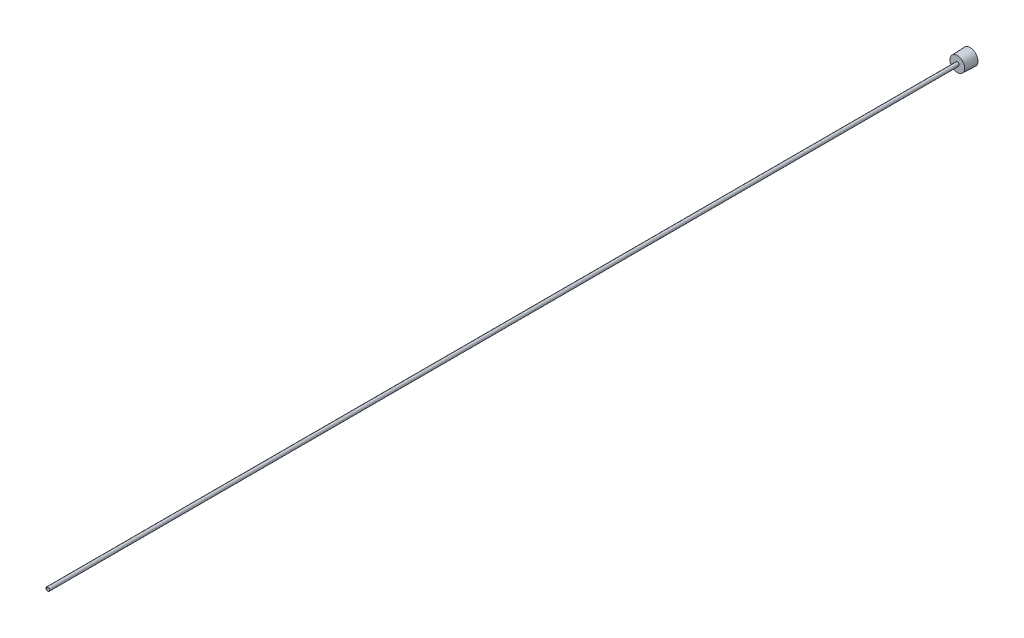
ISO-10303-21;
HEADER;
FILE_DESCRIPTION(('STEP AP214'),'2;1');
FILE_NAME('part.step','',(''),(''),'','','');
FILE_SCHEMA(('AUTOMOTIVE_DESIGN { 1 0 10303 214 1 1 1 1 }'));
ENDSEC;
DATA;
#1=APPLICATION_CONTEXT('core data for automotive mechanical design processes');
#2=APPLICATION_PROTOCOL_DEFINITION('international standard','automotive_design',2000,#1);
#3=PRODUCT_CONTEXT('',#1,'mechanical');
#4=PRODUCT('Part','Part','',(#3));
#5=PRODUCT_RELATED_PRODUCT_CATEGORY('part','',(#4));
#6=PRODUCT_DEFINITION_FORMATION('','',#4);
#7=PRODUCT_DEFINITION_CONTEXT('part definition',#1,'design');
#8=PRODUCT_DEFINITION('design','',#6,#7);
#9=PRODUCT_DEFINITION_SHAPE('','',#8);
#10=(LENGTH_UNIT() NAMED_UNIT(*) SI_UNIT(.MILLI.,.METRE.));
#11=(NAMED_UNIT(*) PLANE_ANGLE_UNIT() SI_UNIT($,.RADIAN.));
#12=(NAMED_UNIT(*) SI_UNIT($,.STERADIAN.) SOLID_ANGLE_UNIT());
#13=UNCERTAINTY_MEASURE_WITH_UNIT(LENGTH_MEASURE(1.E-05),#10,'distance_accuracy_value','');
#14=(GEOMETRIC_REPRESENTATION_CONTEXT(3) GLOBAL_UNCERTAINTY_ASSIGNED_CONTEXT((#13)) GLOBAL_UNIT_ASSIGNED_CONTEXT((#10,
#11,#12)) REPRESENTATION_CONTEXT('',''));
#15=CARTESIAN_POINT('',(0.,0.,0.));
#16=DIRECTION('',(0.,0.,1.));
#17=DIRECTION('',(1.,0.,0.));
#18=AXIS2_PLACEMENT_3D('',#15,#16,#17);
#19=CARTESIAN_POINT('',(0.,0.,0.));
#20=DIRECTION('',(0.,0.,1.));
#21=DIRECTION('',(1.,0.,0.));
#22=AXIS2_PLACEMENT_3D('',#19,#20,#21);
#23=CYLINDRICAL_SURFACE('',#22,0.762);
#24=CARTESIAN_POINT('',(0.,0.,457.2));
#25=DIRECTION('',(0.,0.,1.));
#26=DIRECTION('',(1.,0.,0.));
#27=AXIS2_PLACEMENT_3D('',#24,#25,#26);
#28=CIRCLE('',#27,0.762);
#29=CARTESIAN_POINT('',(0.762,0.,457.2));
#30=VERTEX_POINT('',#29);
#31=EDGE_CURVE('E142',#30,#30,#28,.T.);
#32=ORIENTED_EDGE('',*,*,#31,.T.);
#33=EDGE_LOOP('',(#32));
#34=FACE_BOUND('',#33,.T.);
#35=CARTESIAN_POINT('',(0.,0.,3.96875));
#36=DIRECTION('',(0.,0.,-1.));
#37=DIRECTION('',(-1.,0.,0.));
#38=AXIS2_PLACEMENT_3D('',#35,#36,#37);
#39=CIRCLE('',#38,0.762);
#40=CARTESIAN_POINT('',(-0.762,0.,3.96875));
#41=VERTEX_POINT('',#40);
#42=EDGE_CURVE('E37',#41,#41,#39,.F.);
#43=ORIENTED_EDGE('',*,*,#42,.F.);
#44=EDGE_LOOP('',(#43));
#45=FACE_BOUND('',#44,.T.);
#46=ADVANCED_FACE('F33',(#34,#45),#23,.F.);
#47=CARTESIAN_POINT('',(0.,0.,0.));
#48=DIRECTION('',(0.,0.,1.));
#49=DIRECTION('',(1.,0.,0.));
#50=AXIS2_PLACEMENT_3D('',#47,#48,#49);
#51=PLANE('',#50);
#52=DIRECTION('',(-0.866025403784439,0.5,0.));
#53=VECTOR('',#52,1.);
#54=CARTESIAN_POINT('',(0.,-2.74963065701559,0.));
#55=LINE('',#54,#53);
#56=CARTESIAN_POINT('',(0.,-2.74963065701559,0.));
#57=VERTEX_POINT('',#56);
#58=CARTESIAN_POINT('',(-2.38125,-1.3748153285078,0.));
#59=VERTEX_POINT('',#58);
#60=EDGE_CURVE('E124',#57,#59,#55,.T.);
#61=ORIENTED_EDGE('',*,*,#60,.F.);
#62=DIRECTION('',(-0.866025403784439,-0.5,0.));
#63=VECTOR('',#62,1.);
#64=CARTESIAN_POINT('',(2.38125,-1.3748153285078,0.));
#65=LINE('',#64,#63);
#66=CARTESIAN_POINT('',(2.38125,-1.3748153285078,0.));
#67=VERTEX_POINT('',#66);
#68=EDGE_CURVE('E49',#67,#57,#65,.T.);
#69=ORIENTED_EDGE('',*,*,#68,.F.);
#70=DIRECTION('',(0.,-1.,0.));
#71=VECTOR('',#70,1.);
#72=CARTESIAN_POINT('',(2.38125,1.3748153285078,0.));
#73=LINE('',#72,#71);
#74=CARTESIAN_POINT('',(2.38125,1.3748153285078,0.));
#75=VERTEX_POINT('',#74);
#76=EDGE_CURVE('E133',#75,#67,#73,.T.);
#77=ORIENTED_EDGE('',*,*,#76,.F.);
#78=DIRECTION('',(0.866025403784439,-0.5,0.));
#79=VECTOR('',#78,1.);
#80=CARTESIAN_POINT('',(0.,2.74963065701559,0.));
#81=LINE('',#80,#79);
#82=CARTESIAN_POINT('',(0.,2.74963065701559,0.));
#83=VERTEX_POINT('',#82);
#84=EDGE_CURVE('E131',#83,#75,#81,.T.);
#85=ORIENTED_EDGE('',*,*,#84,.F.);
#86=DIRECTION('',(0.866025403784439,0.5,0.));
#87=VECTOR('',#86,1.);
#88=CARTESIAN_POINT('',(-2.38125,1.3748153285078,0.));
#89=LINE('',#88,#87);
#90=CARTESIAN_POINT('',(-2.38125,1.3748153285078,0.));
#91=VERTEX_POINT('',#90);
#92=EDGE_CURVE('E97',#91,#83,#89,.T.);
#93=ORIENTED_EDGE('',*,*,#92,.F.);
#94=DIRECTION('',(0.,1.,0.));
#95=VECTOR('',#94,1.);
#96=CARTESIAN_POINT('',(-2.38125,-1.3748153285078,0.));
#97=LINE('',#96,#95);
#98=EDGE_CURVE('E127',#59,#91,#97,.T.);
#99=ORIENTED_EDGE('',*,*,#98,.F.);
#100=EDGE_LOOP('',(#61,#69,#77,#85,#93,#99));
#101=FACE_BOUND('',#100,.T.);
#102=CARTESIAN_POINT('',(0.,0.,0.));
#103=DIRECTION('',(0.,0.,1.));
#104=DIRECTION('',(1.,0.,0.));
#105=AXIS2_PLACEMENT_3D('',#102,#103,#104);
#106=CIRCLE('',#105,3.8989);
#107=CARTESIAN_POINT('',(3.8989,0.,0.));
#108=VERTEX_POINT('',#107);
#109=EDGE_CURVE('E11',#108,#108,#106,.T.);
#110=ORIENTED_EDGE('',*,*,#109,.F.);
#111=EDGE_LOOP('',(#110));
#112=FACE_BOUND('',#111,.T.);
#113=ADVANCED_FACE('F35',(#101,#112),#51,.F.);
#114=CARTESIAN_POINT('',(0.,0.,0.));
#115=DIRECTION('',(0.,0.,-1.));
#116=DIRECTION('',(-1.,0.,0.));
#117=AXIS2_PLACEMENT_3D('',#114,#115,#116);
#118=CONICAL_SURFACE('',#117,3.8989,0.0364424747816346);
#119=CARTESIAN_POINT('',(0.,0.,6.35));
#120=DIRECTION('',(0.,0.,1.));
#121=DIRECTION('',(1.,0.,0.));
#122=AXIS2_PLACEMENT_3D('',#119,#120,#121);
#123=CIRCLE('',#122,3.66738778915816);
#124=CARTESIAN_POINT('',(3.66738778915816,0.,6.35));
#125=VERTEX_POINT('',#124);
#126=EDGE_CURVE('E42',#125,#125,#123,.T.);
#127=ORIENTED_EDGE('',*,*,#126,.F.);
#128=EDGE_LOOP('',(#127));
#129=FACE_BOUND('',#128,.T.);
#130=ORIENTED_EDGE('',*,*,#109,.T.);
#131=EDGE_LOOP('',(#130));
#132=FACE_BOUND('',#131,.T.);
#133=ADVANCED_FACE('F156',(#129,#132),#118,.T.);
#134=CARTESIAN_POINT('',(0.,3.66738778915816,6.35));
#135=DIRECTION('',(0.,0.,-1.));
#136=DIRECTION('',(-1.,0.,0.));
#137=AXIS2_PLACEMENT_3D('',#134,#135,#136);
#138=PLANE('',#137);
#139=CARTESIAN_POINT('',(0.,0.,6.35));
#140=DIRECTION('',(0.,0.,1.));
#141=DIRECTION('',(1.,0.,0.));
#142=AXIS2_PLACEMENT_3D('',#139,#140,#141);
#143=CIRCLE('',#142,0.9144);
#144=CARTESIAN_POINT('',(0.9144,0.,6.35));
#145=VERTEX_POINT('',#144);
#146=EDGE_CURVE('E148',#145,#145,#143,.T.);
#147=ORIENTED_EDGE('',*,*,#146,.F.);
#148=EDGE_LOOP('',(#147));
#149=FACE_BOUND('',#148,.T.);
#150=ORIENTED_EDGE('',*,*,#126,.T.);
#151=EDGE_LOOP('',(#150));
#152=FACE_BOUND('',#151,.T.);
#153=ADVANCED_FACE('F154',(#149,#152),#138,.F.);
#154=CARTESIAN_POINT('',(0.,0.,0.));
#155=DIRECTION('',(0.,0.,1.));
#156=DIRECTION('',(1.,0.,0.));
#157=AXIS2_PLACEMENT_3D('',#154,#155,#156);
#158=CYLINDRICAL_SURFACE('',#157,0.914399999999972);
#159=CARTESIAN_POINT('',(0.,0.,457.2));
#160=DIRECTION('',(0.,0.,1.));
#161=DIRECTION('',(1.,0.,0.));
#162=AXIS2_PLACEMENT_3D('',#159,#160,#161);
#163=CIRCLE('',#162,0.914399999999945);
#164=CARTESIAN_POINT('',(0.914399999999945,0.,457.2));
#165=VERTEX_POINT('',#164);
#166=EDGE_CURVE('E145',#165,#165,#163,.T.);
#167=ORIENTED_EDGE('',*,*,#166,.F.);
#168=EDGE_LOOP('',(#167));
#169=FACE_BOUND('',#168,.T.);
#170=ORIENTED_EDGE('',*,*,#146,.T.);
#171=EDGE_LOOP('',(#170));
#172=FACE_BOUND('',#171,.T.);
#173=ADVANCED_FACE('F190',(#169,#172),#158,.T.);
#174=CARTESIAN_POINT('',(0.,0.914399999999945,457.2));
#175=DIRECTION('',(0.,0.,-1.));
#176=DIRECTION('',(-1.,0.,0.));
#177=AXIS2_PLACEMENT_3D('',#174,#175,#176);
#178=PLANE('',#177);
#179=ORIENTED_EDGE('',*,*,#31,.F.);
#180=EDGE_LOOP('',(#179));
#181=FACE_BOUND('',#180,.T.);
#182=ORIENTED_EDGE('',*,*,#166,.T.);
#183=EDGE_LOOP('',(#182));
#184=FACE_BOUND('',#183,.T.);
#185=ADVANCED_FACE('F183',(#181,#184),#178,.F.);
#186=CARTESIAN_POINT('',(0.,-2.74963065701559,3.96875));
#187=DIRECTION('',(0.,0.,-1.));
#188=DIRECTION('',(-1.,0.,0.));
#189=AXIS2_PLACEMENT_3D('',#186,#187,#188);
#190=PLANE('',#189);
#191=DIRECTION('',(-0.866025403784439,-0.5,0.));
#192=VECTOR('',#191,1.);
#193=CARTESIAN_POINT('',(2.38125,-1.3748153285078,3.96875));
#194=LINE('',#193,#192);
#195=CARTESIAN_POINT('',(2.38125,-1.3748153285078,3.96875));
#196=VERTEX_POINT('',#195);
#197=CARTESIAN_POINT('',(0.,-2.74963065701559,3.96875));
#198=VERTEX_POINT('',#197);
#199=EDGE_CURVE('E135',#196,#198,#194,.T.);
#200=ORIENTED_EDGE('',*,*,#199,.T.);
#201=DIRECTION('',(-0.866025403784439,0.5,0.));
#202=VECTOR('',#201,1.);
#203=CARTESIAN_POINT('',(0.,-2.74963065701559,3.96875));
#204=LINE('',#203,#202);
#205=CARTESIAN_POINT('',(-2.38125,-1.3748153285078,3.96875));
#206=VERTEX_POINT('',#205);
#207=EDGE_CURVE('E118',#198,#206,#204,.T.);
#208=ORIENTED_EDGE('',*,*,#207,.T.);
#209=DIRECTION('',(0.,1.,0.));
#210=VECTOR('',#209,1.);
#211=CARTESIAN_POINT('',(-2.38125,-1.3748153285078,3.96875));
#212=LINE('',#211,#210);
#213=CARTESIAN_POINT('',(-2.38125,1.3748153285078,3.96875));
#214=VERTEX_POINT('',#213);
#215=EDGE_CURVE('E116',#206,#214,#212,.T.);
#216=ORIENTED_EDGE('',*,*,#215,.T.);
#217=DIRECTION('',(0.866025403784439,0.5,0.));
#218=VECTOR('',#217,1.);
#219=CARTESIAN_POINT('',(-2.38125,1.3748153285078,3.96875));
#220=LINE('',#219,#218);
#221=CARTESIAN_POINT('',(0.,2.74963065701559,3.96875));
#222=VERTEX_POINT('',#221);
#223=EDGE_CURVE('E94',#214,#222,#220,.T.);
#224=ORIENTED_EDGE('',*,*,#223,.T.);
#225=DIRECTION('',(0.866025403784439,-0.5,0.));
#226=VECTOR('',#225,1.);
#227=CARTESIAN_POINT('',(0.,2.74963065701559,3.96875));
#228=LINE('',#227,#226);
#229=CARTESIAN_POINT('',(2.38125,1.3748153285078,3.96875));
#230=VERTEX_POINT('',#229);
#231=EDGE_CURVE('E105',#222,#230,#228,.T.);
#232=ORIENTED_EDGE('',*,*,#231,.T.);
#233=DIRECTION('',(0.,-1.,0.));
#234=VECTOR('',#233,1.);
#235=CARTESIAN_POINT('',(2.38125,1.3748153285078,3.96875));
#236=LINE('',#235,#234);
#237=EDGE_CURVE('E109',#230,#196,#236,.T.);
#238=ORIENTED_EDGE('',*,*,#237,.T.);
#239=EDGE_LOOP('',(#200,#208,#216,#224,#232,#238));
#240=FACE_BOUND('',#239,.T.);
#241=ORIENTED_EDGE('',*,*,#42,.T.);
#242=EDGE_LOOP('',(#241));
#243=FACE_BOUND('',#242,.T.);
#244=ADVANCED_FACE('F112',(#240,#243),#190,.T.);
#245=CARTESIAN_POINT('',(2.38125,-1.3748153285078,3.96875));
#246=DIRECTION('',(0.5,-0.866025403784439,0.));
#247=DIRECTION('',(0.866025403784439,0.5,0.));
#248=AXIS2_PLACEMENT_3D('',#245,#246,#247);
#249=PLANE('',#248);
#250=ORIENTED_EDGE('',*,*,#68,.T.);
#251=DIRECTION('',(0.,0.,-1.));
#252=VECTOR('',#251,1.);
#253=CARTESIAN_POINT('',(0.,-2.74963065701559,3.96875));
#254=LINE('',#253,#252);
#255=EDGE_CURVE('E79',#198,#57,#254,.T.);
#256=ORIENTED_EDGE('',*,*,#255,.F.);
#257=ORIENTED_EDGE('',*,*,#199,.F.);
#258=DIRECTION('',(0.,0.,-1.));
#259=VECTOR('',#258,1.);
#260=CARTESIAN_POINT('',(2.38125,-1.3748153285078,3.96875));
#261=LINE('',#260,#259);
#262=EDGE_CURVE('E57',#196,#67,#261,.T.);
#263=ORIENTED_EDGE('',*,*,#262,.T.);
#264=EDGE_LOOP('',(#250,#256,#257,#263));
#265=FACE_BOUND('',#264,.T.);
#266=ADVANCED_FACE('F174',(#265),#249,.F.);
#267=CARTESIAN_POINT('',(2.38125,1.3748153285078,3.96875));
#268=DIRECTION('',(1.,0.,0.));
#269=DIRECTION('',(0.,0.,-1.));
#270=AXIS2_PLACEMENT_3D('',#267,#268,#269);
#271=PLANE('',#270);
#272=ORIENTED_EDGE('',*,*,#76,.T.);
#273=ORIENTED_EDGE('',*,*,#262,.F.);
#274=ORIENTED_EDGE('',*,*,#237,.F.);
#275=DIRECTION('',(0.,0.,-1.));
#276=VECTOR('',#275,1.);
#277=CARTESIAN_POINT('',(2.38125,1.3748153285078,3.96875));
#278=LINE('',#277,#276);
#279=EDGE_CURVE('E101',#230,#75,#278,.T.);
#280=ORIENTED_EDGE('',*,*,#279,.T.);
#281=EDGE_LOOP('',(#272,#273,#274,#280));
#282=FACE_BOUND('',#281,.T.);
#283=ADVANCED_FACE('F176',(#282),#271,.F.);
#284=CARTESIAN_POINT('',(0.,2.74963065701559,3.96875));
#285=DIRECTION('',(0.5,0.866025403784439,0.));
#286=DIRECTION('',(-0.866025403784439,0.5,0.));
#287=AXIS2_PLACEMENT_3D('',#284,#285,#286);
#288=PLANE('',#287);
#289=ORIENTED_EDGE('',*,*,#84,.T.);
#290=ORIENTED_EDGE('',*,*,#279,.F.);
#291=ORIENTED_EDGE('',*,*,#231,.F.);
#292=DIRECTION('',(0.,0.,-1.));
#293=VECTOR('',#292,1.);
#294=CARTESIAN_POINT('',(0.,2.74963065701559,3.96875));
#295=LINE('',#294,#293);
#296=EDGE_CURVE('E90',#222,#83,#295,.T.);
#297=ORIENTED_EDGE('',*,*,#296,.T.);
#298=EDGE_LOOP('',(#289,#290,#291,#297));
#299=FACE_BOUND('',#298,.T.);
#300=ADVANCED_FACE('F106',(#299),#288,.F.);
#301=CARTESIAN_POINT('',(-2.38125,1.3748153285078,3.96875));
#302=DIRECTION('',(-0.5,0.866025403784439,0.));
#303=DIRECTION('',(-0.866025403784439,-0.5,0.));
#304=AXIS2_PLACEMENT_3D('',#301,#302,#303);
#305=PLANE('',#304);
#306=ORIENTED_EDGE('',*,*,#92,.T.);
#307=ORIENTED_EDGE('',*,*,#296,.F.);
#308=ORIENTED_EDGE('',*,*,#223,.F.);
#309=DIRECTION('',(0.,0.,-1.));
#310=VECTOR('',#309,1.);
#311=CARTESIAN_POINT('',(-2.38125,1.3748153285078,3.96875));
#312=LINE('',#311,#310);
#313=EDGE_CURVE('E102',#214,#91,#312,.T.);
#314=ORIENTED_EDGE('',*,*,#313,.T.);
#315=EDGE_LOOP('',(#306,#307,#308,#314));
#316=FACE_BOUND('',#315,.T.);
#317=ADVANCED_FACE('F92',(#316),#305,.F.);
#318=CARTESIAN_POINT('',(-2.38125,-1.3748153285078,3.96875));
#319=DIRECTION('',(-1.,0.,0.));
#320=DIRECTION('',(0.,0.,1.));
#321=AXIS2_PLACEMENT_3D('',#318,#319,#320);
#322=PLANE('',#321);
#323=ORIENTED_EDGE('',*,*,#98,.T.);
#324=ORIENTED_EDGE('',*,*,#313,.F.);
#325=ORIENTED_EDGE('',*,*,#215,.F.);
#326=DIRECTION('',(0.,0.,-1.));
#327=VECTOR('',#326,1.);
#328=CARTESIAN_POINT('',(-2.38125,-1.3748153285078,3.96875));
#329=LINE('',#328,#327);
#330=EDGE_CURVE('E139',#206,#59,#329,.T.);
#331=ORIENTED_EDGE('',*,*,#330,.T.);
#332=EDGE_LOOP('',(#323,#324,#325,#331));
#333=FACE_BOUND('',#332,.T.);
#334=ADVANCED_FACE('F246',(#333),#322,.F.);
#335=CARTESIAN_POINT('',(0.,-2.74963065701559,3.96875));
#336=DIRECTION('',(-0.5,-0.866025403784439,0.));
#337=DIRECTION('',(0.866025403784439,-0.5,0.));
#338=AXIS2_PLACEMENT_3D('',#335,#336,#337);
#339=PLANE('',#338);
#340=ORIENTED_EDGE('',*,*,#60,.T.);
#341=ORIENTED_EDGE('',*,*,#330,.F.);
#342=ORIENTED_EDGE('',*,*,#207,.F.);
#343=ORIENTED_EDGE('',*,*,#255,.T.);
#344=EDGE_LOOP('',(#340,#341,#342,#343));
#345=FACE_BOUND('',#344,.T.);
#346=ADVANCED_FACE('F172',(#345),#339,.F.);
#347=CLOSED_SHELL('',(#46,#113,#133,#153,#173,#185,#244,#266,#283,#300,#317,#334,#346));
#348=MANIFOLD_SOLID_BREP('B2',#347);
#349=ADVANCED_BREP_SHAPE_REPRESENTATION('',(#18,#348),#14);
#350=SHAPE_DEFINITION_REPRESENTATION(#9,#349);
ENDSEC;
END-ISO-10303-21;
